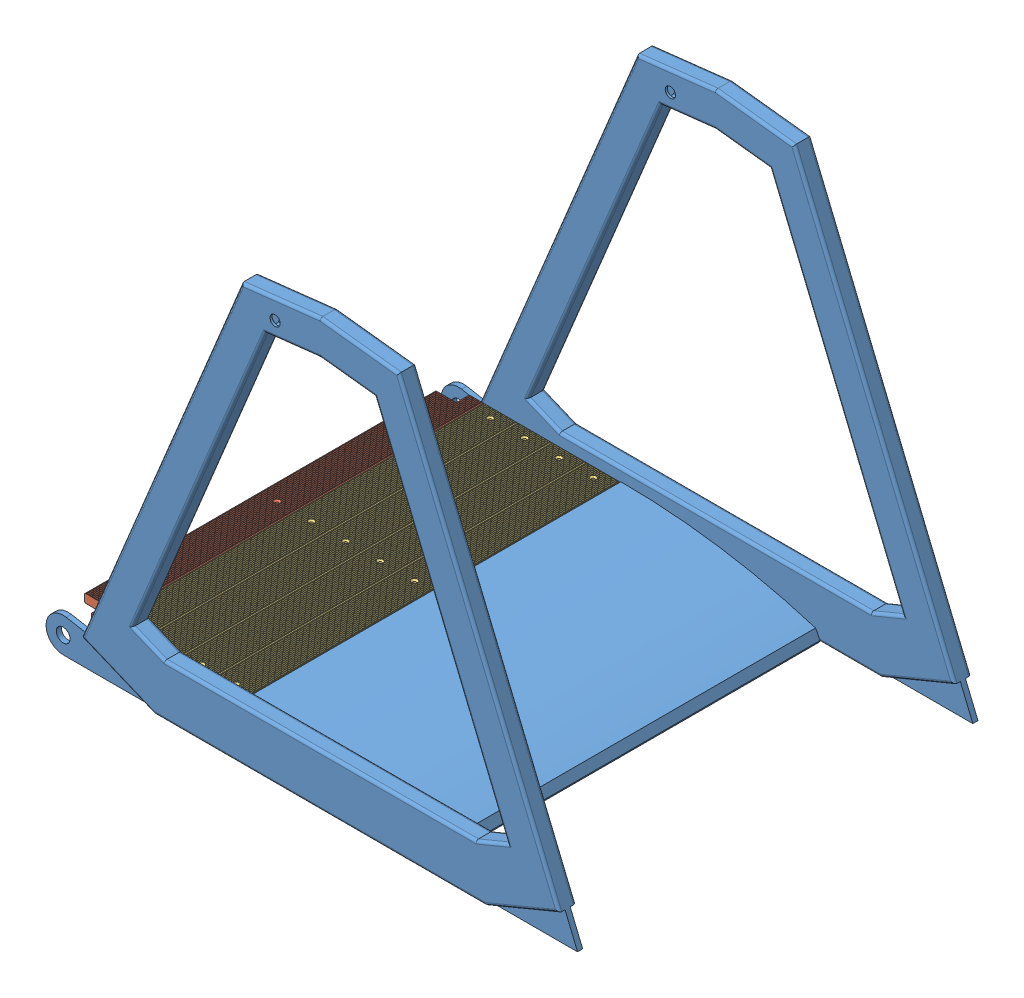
SolidWorks assembly Segment1 et bois.SLDASM, configuration Défaut (file format 4400). Lengths in mm.
Overall size (1546.43 1240 1200).
6 component instances, 3 part files, 6 mates.
Components (placement in the parent):
- Segment 1-1: Segment 1.SLDPRT [Défaut] at origin size (1546.43 1240 1200)
- Planche superieure cote 2-1: Planche superieure cote 2.SLDPRT [Défaut] at (-725 52.5 -575) x (-1 0 0) z (0 0 -1) size (100 25 1100)
- Planche superieure-1: Planche superieure.SLDPRT [Défaut] at (-625 52.5 -575) size (100 25 1100)
- Planche superieure-3: Planche superieure.SLDPRT [Défaut] at (-525 52.5 -575) size (100 25 1100)
- Planche superieure-4: Planche superieure.SLDPRT [Défaut] at (-425 52.5 -575) size (100 25 1100)
- Planche superieure-5: Planche superieure.SLDPRT [Défaut] at (-325 52.5 -575) size (100 25 1100)
Mates (geometry in assembly coordinates):
- Coïncidente1: coincident anti-aligned: plane of Segment 1-1 through (-373 40 -1125) normal (0 1 0); plane of Planche superieure cote 2-1 through (-775 40 -1125) normal (0 -1 0)
- Coïncidente2: coincident anti-aligned: plane of Segment 1-1 through (695 37.9548 -1125) normal (0 0 1); plane of Planche superieure cote 2-1 through (-775 65 -1125) normal (0 0 -1)
- Coïncidente3: coincident aligned: plane of Planche superieure cote 2-1 through (-775 40 -1125) normal (0 -1 0); plane of Planche superieure-1 through (-575 40 -25) normal (0 -1 0)
- Coïncidente4: coincident anti-aligned: plane of Planche superieure cote 2-1 through (-675 40 -1125) normal (1 0 0); plane of Planche superieure-1 through (-675 40 -25) normal (-1 0 0)
- Coïncidente5: coincident aligned: plane of Planche superieure cote 2-1 through (-775 65 -25) normal (0 0 1); plane of Planche superieure-1 through (-575 65 -25) normal (0 0 1)
- Distance1: distance: line of Segment 1-1 through (-695 37.9548 7.5) axis (0 0 -1); plane of Planche superieure cote 2-1 through (-775 40 -1125) normal (-1 0 0); sketch_entity of Planche superieure-1
